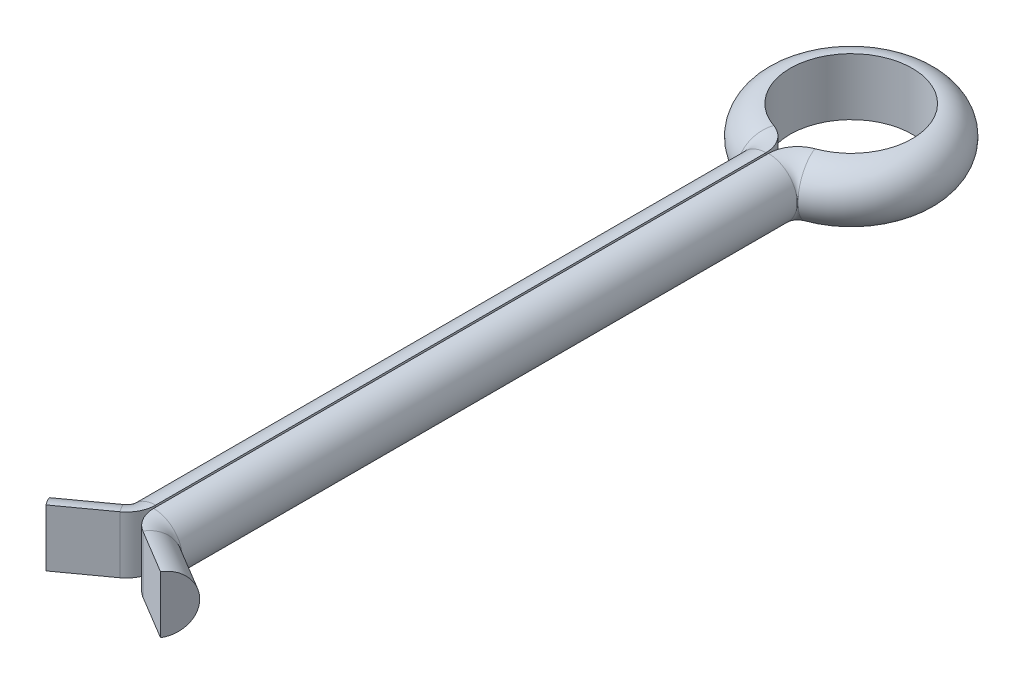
from build123d import *


with BuildPart() as part:
    # Balayage3: sweep along a path in Esquisse2
    with BuildLine(Plane(origin=(0, 0, 0), x_dir=(1, 0, 0), z_dir=(0, 1, 0))) as balayage3_path:
        Line((-5.672171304, -4.102008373), (-1.241996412, -0.898188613))
        ThreePointArc((-1.241996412, -0.898188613), (-0.328482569, 0.167826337), (0, 1.532741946))
        Line((0, 1.532741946), (0, 64.497159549))
        ThreePointArc((0, 64.497159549), (-0.560407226, 66.243122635), (-2.032258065, 67.336785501))
        ThreePointArc((-2.032258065, 67.336785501), (-0.071851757, 79.599590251), (2.167741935, 67.384689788))
        ThreePointArc((2.167741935, 67.384689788), (0.740653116, 66.285901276), (0.2, 64.567875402))
        Line((0.2, 64.567875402), (0.2, 1.133248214))
        ThreePointArc((0.2, 1.133248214), (0.589885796, -0.345705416), (1.658202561, -1.440243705))
        Line((1.658202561, -1.440243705), (6.204814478, -4.164151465))
    # Esquisse3 → Balayage3 (sweep)
    with BuildSketch(Plane(origin=(6.204814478, 0, 4.164151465), x_dir=(0.5139324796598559, 0, -0.8578306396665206), z_dir=(0.8578306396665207, 0, 0.5139324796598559))):
        with BuildLine():
            Line((0, 2.95), (0, -2.95))
            ThreePointArc((0, -2.95), (2.95, 0), (0, 2.95))
        make_face()
    sweep(path=balayage3_path.line)


solid = part.part
